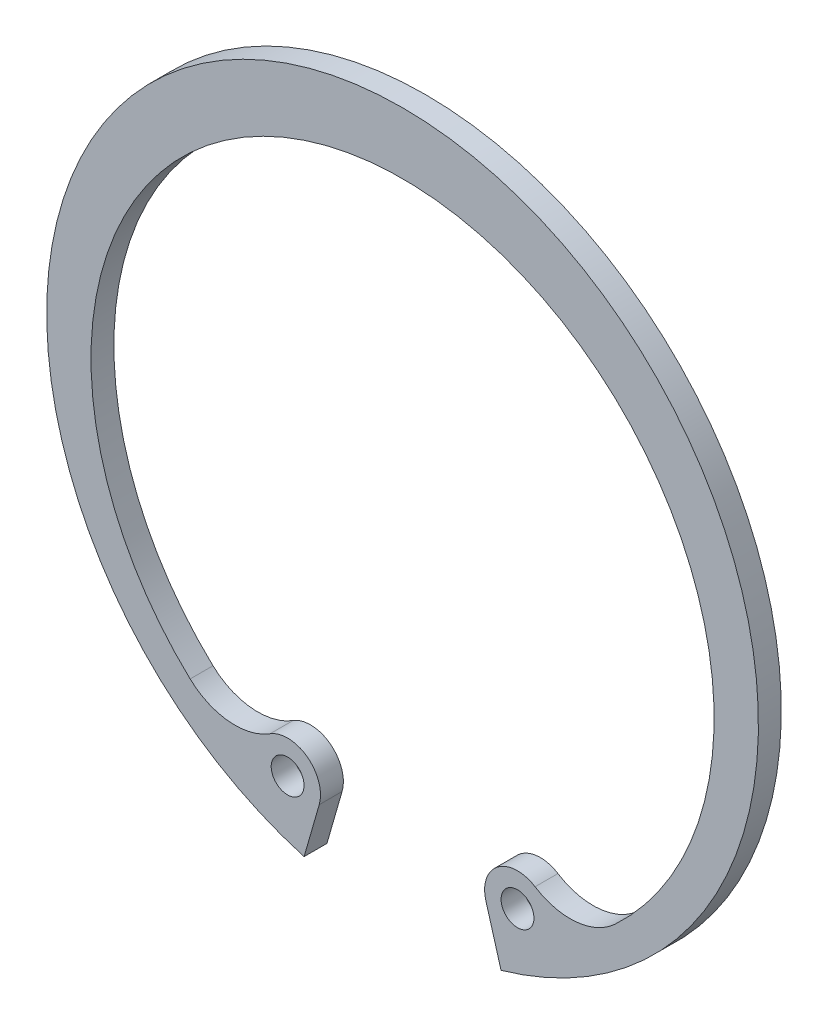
from build123d import *

# Parameters (mm, degrees)
BODYSKE_R  = 1.15
BODY_DEPTH = 1.6


with BuildPart() as part:
    # BodySke → Body (new body)
    with BuildSketch(Plane.XY):
        with BuildLine():
            Line((6.891047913, -23.927462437), (5.832446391, -20.251730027))
            ThreePointArc((5.832446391, -20.251730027), (6.661890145, -17.775750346), (9.270993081, -17.670706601))
            ThreePointArc((9.270993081, -17.670706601), (12.156921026, -18.361640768), (14.864245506, -17.146583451))
            ThreePointArc((14.864245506, -17.146583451), (0, 20.6), (-14.864245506, -17.146583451))
            ThreePointArc((-14.864245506, -17.146583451), (-12.156921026, -18.361640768), (-9.270993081, -17.670706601))
            ThreePointArc((-9.270993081, -17.670706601), (-6.661890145, -17.775750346), (-5.832446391, -20.251730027))
            Line((-5.832446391, -20.251730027), (-6.891047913, -23.927462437))
            ThreePointArc((-6.891047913, -23.927462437), (0, 24.9), (6.891047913, -23.927462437))
        make_face()
        with Locations((8.042613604, -19.615207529)):
            Circle(BODYSKE_R, mode=Mode.SUBTRACT)
        with Locations((-8.042613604, -19.615207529)):
            Circle(BODYSKE_R, mode=Mode.SUBTRACT)
    extrude(amount=-BODY_DEPTH)


solid = part.part
